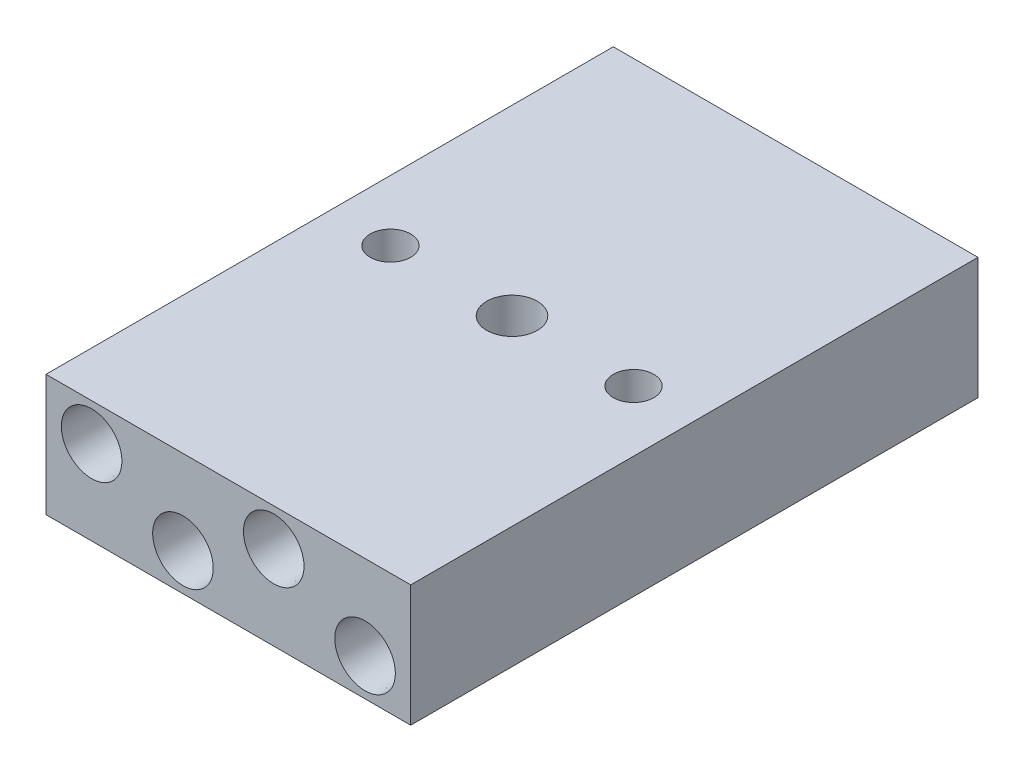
ISO-10303-21;
HEADER;
FILE_DESCRIPTION(('STEP AP214'),'2;1');
FILE_NAME('part.step','',(''),(''),'','','');
FILE_SCHEMA(('AUTOMOTIVE_DESIGN { 1 0 10303 214 1 1 1 1 }'));
ENDSEC;
DATA;
#1=APPLICATION_CONTEXT('core data for automotive mechanical design processes');
#2=APPLICATION_PROTOCOL_DEFINITION('international standard','automotive_design',2000,#1);
#3=PRODUCT_CONTEXT('',#1,'mechanical');
#4=PRODUCT('Part','Part','',(#3));
#5=PRODUCT_RELATED_PRODUCT_CATEGORY('part','',(#4));
#6=PRODUCT_DEFINITION_FORMATION('','',#4);
#7=PRODUCT_DEFINITION_CONTEXT('part definition',#1,'design');
#8=PRODUCT_DEFINITION('design','',#6,#7);
#9=PRODUCT_DEFINITION_SHAPE('','',#8);
#10=(LENGTH_UNIT() NAMED_UNIT(*) SI_UNIT(.MILLI.,.METRE.));
#11=(NAMED_UNIT(*) PLANE_ANGLE_UNIT() SI_UNIT($,.RADIAN.));
#12=(NAMED_UNIT(*) SI_UNIT($,.STERADIAN.) SOLID_ANGLE_UNIT());
#13=UNCERTAINTY_MEASURE_WITH_UNIT(LENGTH_MEASURE(1.E-05),#10,'distance_accuracy_value','');
#14=(GEOMETRIC_REPRESENTATION_CONTEXT(3) GLOBAL_UNCERTAINTY_ASSIGNED_CONTEXT((#13)) GLOBAL_UNIT_ASSIGNED_CONTEXT((#10,
#11,#12)) REPRESENTATION_CONTEXT('',''));
#15=CARTESIAN_POINT('',(0.,0.,0.));
#16=DIRECTION('',(0.,0.,1.));
#17=DIRECTION('',(1.,0.,0.));
#18=AXIS2_PLACEMENT_3D('',#15,#16,#17);
#19=CARTESIAN_POINT('',(-28.575,9.525,-88.9));
#20=DIRECTION('',(-1.,0.,0.));
#21=DIRECTION('',(0.,0.,1.));
#22=AXIS2_PLACEMENT_3D('',#19,#20,#21);
#23=PLANE('',#22);
#24=DIRECTION('',(0.,-1.,0.));
#25=VECTOR('',#24,1.);
#26=CARTESIAN_POINT('',(-28.575,9.525,0.));
#27=LINE('',#26,#25);
#28=CARTESIAN_POINT('',(-28.575,9.525,0.));
#29=VERTEX_POINT('',#28);
#30=CARTESIAN_POINT('',(-28.575,-9.525,0.));
#31=VERTEX_POINT('',#30);
#32=EDGE_CURVE('E145',#29,#31,#27,.T.);
#33=ORIENTED_EDGE('',*,*,#32,.F.);
#34=DIRECTION('',(0.,0.,1.));
#35=VECTOR('',#34,1.);
#36=CARTESIAN_POINT('',(-28.575,9.525,-88.9));
#37=LINE('',#36,#35);
#38=CARTESIAN_POINT('',(-28.575,9.525,-88.9));
#39=VERTEX_POINT('',#38);
#40=EDGE_CURVE('E11',#39,#29,#37,.T.);
#41=ORIENTED_EDGE('',*,*,#40,.F.);
#42=DIRECTION('',(0.,-1.,0.));
#43=VECTOR('',#42,1.);
#44=CARTESIAN_POINT('',(-28.575,9.525,-88.9));
#45=LINE('',#44,#43);
#46=CARTESIAN_POINT('',(-28.575,-9.525,-88.9));
#47=VERTEX_POINT('',#46);
#48=EDGE_CURVE('E146',#39,#47,#45,.T.);
#49=ORIENTED_EDGE('',*,*,#48,.T.);
#50=DIRECTION('',(0.,0.,1.));
#51=VECTOR('',#50,1.);
#52=CARTESIAN_POINT('',(-28.575,-9.525,-88.9));
#53=LINE('',#52,#51);
#54=EDGE_CURVE('E37',#47,#31,#53,.T.);
#55=ORIENTED_EDGE('',*,*,#54,.T.);
#56=EDGE_LOOP('',(#33,#41,#49,#55));
#57=FACE_BOUND('',#56,.T.);
#58=ADVANCED_FACE('F34',(#57),#23,.T.);
#59=CARTESIAN_POINT('',(-28.575,9.525,-88.9));
#60=DIRECTION('',(0.,1.,0.));
#61=DIRECTION('',(0.,0.,1.));
#62=AXIS2_PLACEMENT_3D('',#59,#60,#61);
#63=PLANE('',#62);
#64=CARTESIAN_POINT('',(19.05,9.525,-44.45));
#65=DIRECTION('',(0.,1.,0.));
#66=DIRECTION('',(0.,0.,-1.));
#67=AXIS2_PLACEMENT_3D('',#64,#65,#66);
#68=CIRCLE('',#67,3.175);
#69=CARTESIAN_POINT('',(19.05,9.525,-47.625));
#70=VERTEX_POINT('',#69);
#71=EDGE_CURVE('E198',#70,#70,#68,.T.);
#72=ORIENTED_EDGE('',*,*,#71,.F.);
#73=EDGE_LOOP('',(#72));
#74=FACE_BOUND('',#73,.T.);
#75=CARTESIAN_POINT('',(-19.05,9.525,-44.45));
#76=DIRECTION('',(0.,1.,0.));
#77=DIRECTION('',(0.,0.,1.));
#78=AXIS2_PLACEMENT_3D('',#75,#76,#77);
#79=CIRCLE('',#78,3.175);
#80=CARTESIAN_POINT('',(-19.05,9.525,-41.275));
#81=VERTEX_POINT('',#80);
#82=EDGE_CURVE('E202',#81,#81,#79,.T.);
#83=ORIENTED_EDGE('',*,*,#82,.F.);
#84=EDGE_LOOP('',(#83));
#85=FACE_BOUND('',#84,.T.);
#86=CARTESIAN_POINT('',(0.,9.525,-44.45));
#87=DIRECTION('',(0.,-1.,0.));
#88=DIRECTION('',(0.,0.,-1.));
#89=AXIS2_PLACEMENT_3D('',#86,#87,#88);
#90=CIRCLE('',#89,3.96875);
#91=CARTESIAN_POINT('',(0.,9.525,-48.41875));
#92=VERTEX_POINT('',#91);
#93=EDGE_CURVE('E205',#92,#92,#90,.T.);
#94=ORIENTED_EDGE('',*,*,#93,.T.);
#95=EDGE_LOOP('',(#94));
#96=FACE_BOUND('',#95,.T.);
#97=DIRECTION('',(-1.,0.,0.));
#98=VECTOR('',#97,1.);
#99=CARTESIAN_POINT('',(-28.575,9.525,0.));
#100=LINE('',#99,#98);
#101=CARTESIAN_POINT('',(28.575,9.525,0.));
#102=VERTEX_POINT('',#101);
#103=EDGE_CURVE('E149',#102,#29,#100,.T.);
#104=ORIENTED_EDGE('',*,*,#103,.F.);
#105=DIRECTION('',(0.,0.,1.));
#106=VECTOR('',#105,1.);
#107=CARTESIAN_POINT('',(28.575,9.525,-88.9));
#108=LINE('',#107,#106);
#109=CARTESIAN_POINT('',(28.575,9.525,-88.9));
#110=VERTEX_POINT('',#109);
#111=EDGE_CURVE('E43',#110,#102,#108,.T.);
#112=ORIENTED_EDGE('',*,*,#111,.F.);
#113=DIRECTION('',(-1.,0.,0.));
#114=VECTOR('',#113,1.);
#115=CARTESIAN_POINT('',(-28.575,9.525,-88.9));
#116=LINE('',#115,#114);
#117=EDGE_CURVE('E153',#110,#39,#116,.T.);
#118=ORIENTED_EDGE('',*,*,#117,.T.);
#119=ORIENTED_EDGE('',*,*,#40,.T.);
#120=EDGE_LOOP('',(#104,#112,#118,#119));
#121=FACE_BOUND('',#120,.T.);
#122=ADVANCED_FACE('F168',(#74,#85,#96,#121),#63,.T.);
#123=CARTESIAN_POINT('',(28.575,9.525,-88.9));
#124=DIRECTION('',(1.,0.,0.));
#125=DIRECTION('',(0.,0.,-1.));
#126=AXIS2_PLACEMENT_3D('',#123,#124,#125);
#127=PLANE('',#126);
#128=DIRECTION('',(0.,1.,0.));
#129=VECTOR('',#128,1.);
#130=CARTESIAN_POINT('',(28.575,9.525,0.));
#131=LINE('',#130,#129);
#132=CARTESIAN_POINT('',(28.575,-9.525,0.));
#133=VERTEX_POINT('',#132);
#134=EDGE_CURVE('E160',#133,#102,#131,.T.);
#135=ORIENTED_EDGE('',*,*,#134,.F.);
#136=DIRECTION('',(0.,0.,1.));
#137=VECTOR('',#136,1.);
#138=CARTESIAN_POINT('',(28.575,-9.525,-88.9));
#139=LINE('',#138,#137);
#140=CARTESIAN_POINT('',(28.575,-9.525,-88.9));
#141=VERTEX_POINT('',#140);
#142=EDGE_CURVE('E164',#141,#133,#139,.T.);
#143=ORIENTED_EDGE('',*,*,#142,.F.);
#144=DIRECTION('',(0.,1.,0.));
#145=VECTOR('',#144,1.);
#146=CARTESIAN_POINT('',(28.575,9.525,-88.9));
#147=LINE('',#146,#145);
#148=EDGE_CURVE('E151',#141,#110,#147,.T.);
#149=ORIENTED_EDGE('',*,*,#148,.T.);
#150=ORIENTED_EDGE('',*,*,#111,.T.);
#151=EDGE_LOOP('',(#135,#143,#149,#150));
#152=FACE_BOUND('',#151,.T.);
#153=ADVANCED_FACE('F171',(#152),#127,.T.);
#154=CARTESIAN_POINT('',(-28.575,-9.525,-88.9));
#155=DIRECTION('',(0.,-1.,0.));
#156=DIRECTION('',(0.,0.,-1.));
#157=AXIS2_PLACEMENT_3D('',#154,#155,#156);
#158=PLANE('',#157);
#159=CARTESIAN_POINT('',(0.,-9.525,-44.45));
#160=DIRECTION('',(0.,-1.,0.));
#161=DIRECTION('',(0.,0.,-1.));
#162=AXIS2_PLACEMENT_3D('',#159,#160,#161);
#163=CIRCLE('',#162,3.96875);
#164=CARTESIAN_POINT('',(0.,-9.525,-48.41875));
#165=VERTEX_POINT('',#164);
#166=EDGE_CURVE('E208',#165,#165,#163,.T.);
#167=ORIENTED_EDGE('',*,*,#166,.F.);
#168=EDGE_LOOP('',(#167));
#169=FACE_BOUND('',#168,.T.);
#170=DIRECTION('',(1.,0.,0.));
#171=VECTOR('',#170,1.);
#172=CARTESIAN_POINT('',(-28.575,-9.525,0.));
#173=LINE('',#172,#171);
#174=EDGE_CURVE('E157',#31,#133,#173,.T.);
#175=ORIENTED_EDGE('',*,*,#174,.F.);
#176=ORIENTED_EDGE('',*,*,#54,.F.);
#177=DIRECTION('',(1.,0.,0.));
#178=VECTOR('',#177,1.);
#179=CARTESIAN_POINT('',(-28.575,-9.525,-88.9));
#180=LINE('',#179,#178);
#181=EDGE_CURVE('E148',#47,#141,#180,.T.);
#182=ORIENTED_EDGE('',*,*,#181,.T.);
#183=ORIENTED_EDGE('',*,*,#142,.T.);
#184=EDGE_LOOP('',(#175,#176,#182,#183));
#185=FACE_BOUND('',#184,.T.);
#186=ADVANCED_FACE('F165',(#169,#185),#158,.T.);
#187=CARTESIAN_POINT('',(-28.575,-9.525,-88.9));
#188=DIRECTION('',(0.,0.,1.));
#189=DIRECTION('',(1.,0.,0.));
#190=AXIS2_PLACEMENT_3D('',#187,#188,#189);
#191=PLANE('',#190);
#192=ORIENTED_EDGE('',*,*,#48,.F.);
#193=ORIENTED_EDGE('',*,*,#117,.F.);
#194=ORIENTED_EDGE('',*,*,#148,.F.);
#195=ORIENTED_EDGE('',*,*,#181,.F.);
#196=EDGE_LOOP('',(#192,#193,#194,#195));
#197=FACE_BOUND('',#196,.T.);
#198=ADVANCED_FACE('F173',(#197),#191,.F.);
#199=CARTESIAN_POINT('',(-28.575,-9.525,0.));
#200=DIRECTION('',(0.,0.,1.));
#201=DIRECTION('',(1.,0.,0.));
#202=AXIS2_PLACEMENT_3D('',#199,#200,#201);
#203=PLANE('',#202);
#204=CARTESIAN_POINT('',(-21.4249,3.683,0.));
#205=DIRECTION('',(0.,0.,1.));
#206=DIRECTION('',(1.,0.,0.));
#207=AXIS2_PLACEMENT_3D('',#204,#205,#206);
#208=CIRCLE('',#207,4.74472);
#209=CARTESIAN_POINT('',(-16.68018,3.683,0.));
#210=VERTEX_POINT('',#209);
#211=EDGE_CURVE('E207',#210,#210,#208,.T.);
#212=ORIENTED_EDGE('',*,*,#211,.F.);
#213=EDGE_LOOP('',(#212));
#214=FACE_BOUND('',#213,.T.);
#215=CARTESIAN_POINT('',(-7.112,-3.683,0.));
#216=DIRECTION('',(0.,0.,1.));
#217=DIRECTION('',(1.,0.,0.));
#218=AXIS2_PLACEMENT_3D('',#215,#216,#217);
#219=CIRCLE('',#218,4.74472);
#220=CARTESIAN_POINT('',(-2.36728,-3.683,0.));
#221=VERTEX_POINT('',#220);
#222=EDGE_CURVE('E102',#221,#221,#219,.T.);
#223=ORIENTED_EDGE('',*,*,#222,.F.);
#224=EDGE_LOOP('',(#223));
#225=FACE_BOUND('',#224,.T.);
#226=CARTESIAN_POINT('',(7.112,3.683,0.));
#227=DIRECTION('',(0.,0.,1.));
#228=DIRECTION('',(1.,0.,0.));
#229=AXIS2_PLACEMENT_3D('',#226,#227,#228);
#230=CIRCLE('',#229,4.74472);
#231=CARTESIAN_POINT('',(11.85672,3.683,0.));
#232=VERTEX_POINT('',#231);
#233=EDGE_CURVE('E121',#232,#232,#230,.T.);
#234=ORIENTED_EDGE('',*,*,#233,.F.);
#235=EDGE_LOOP('',(#234));
#236=FACE_BOUND('',#235,.T.);
#237=CARTESIAN_POINT('',(21.4249,-3.683,0.));
#238=DIRECTION('',(0.,0.,1.));
#239=DIRECTION('',(1.,0.,0.));
#240=AXIS2_PLACEMENT_3D('',#237,#238,#239);
#241=CIRCLE('',#240,4.74472);
#242=CARTESIAN_POINT('',(26.16962,-3.683,0.));
#243=VERTEX_POINT('',#242);
#244=EDGE_CURVE('E133',#243,#243,#241,.T.);
#245=ORIENTED_EDGE('',*,*,#244,.F.);
#246=EDGE_LOOP('',(#245));
#247=FACE_BOUND('',#246,.T.);
#248=ORIENTED_EDGE('',*,*,#32,.T.);
#249=ORIENTED_EDGE('',*,*,#174,.T.);
#250=ORIENTED_EDGE('',*,*,#134,.T.);
#251=ORIENTED_EDGE('',*,*,#103,.T.);
#252=EDGE_LOOP('',(#248,#249,#250,#251));
#253=FACE_BOUND('',#252,.T.);
#254=ADVANCED_FACE('F167',(#214,#225,#236,#247,#253),#203,.T.);
#255=CARTESIAN_POINT('',(21.4249,-3.683,-11.6229892));
#256=DIRECTION('',(0.,0.,1.));
#257=DIRECTION('',(1.,0.,0.));
#258=AXIS2_PLACEMENT_3D('',#255,#256,#257);
#259=CONICAL_SURFACE('',#258,4.21640000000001,1.02974425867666);
#260=CARTESIAN_POINT('',(21.4249,-3.683,-14.1564579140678));
#261=VERTEX_POINT('',#260);
#262=VERTEX_LOOP('',#261);
#263=FACE_BOUND('',#262,.T.);
#264=CARTESIAN_POINT('',(21.4249,-3.683,-11.6229892));
#265=DIRECTION('',(0.,0.,1.));
#266=DIRECTION('',(1.,0.,0.));
#267=AXIS2_PLACEMENT_3D('',#264,#265,#266);
#268=CIRCLE('',#267,4.21640000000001);
#269=CARTESIAN_POINT('',(25.6413,-3.683,-11.6229892));
#270=VERTEX_POINT('',#269);
#271=EDGE_CURVE('E142',#270,#270,#268,.T.);
#272=ORIENTED_EDGE('',*,*,#271,.T.);
#273=EDGE_LOOP('',(#272));
#274=FACE_BOUND('',#273,.T.);
#275=ADVANCED_FACE('F180',(#263,#274),#259,.F.);
#276=CARTESIAN_POINT('',(21.4249,-3.683,0.));
#277=DIRECTION('',(0.,0.,1.));
#278=DIRECTION('',(1.,0.,0.));
#279=AXIS2_PLACEMENT_3D('',#276,#277,#278);
#280=CYLINDRICAL_SURFACE('',#279,4.21640000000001);
#281=ORIENTED_EDGE('',*,*,#271,.F.);
#282=EDGE_LOOP('',(#281));
#283=FACE_BOUND('',#282,.T.);
#284=CARTESIAN_POINT('',(21.4249,-3.683,-6.9239892));
#285=DIRECTION('',(0.,0.,1.));
#286=DIRECTION('',(1.,0.,0.));
#287=AXIS2_PLACEMENT_3D('',#284,#285,#286);
#288=CIRCLE('',#287,4.2164);
#289=CARTESIAN_POINT('',(25.6413,-3.683,-6.9239892));
#290=VERTEX_POINT('',#289);
#291=EDGE_CURVE('E139',#290,#290,#288,.T.);
#292=ORIENTED_EDGE('',*,*,#291,.T.);
#293=EDGE_LOOP('',(#292));
#294=FACE_BOUND('',#293,.T.);
#295=ADVANCED_FACE('F248',(#283,#294),#280,.F.);
#296=CARTESIAN_POINT('',(25.6413,-3.683,-6.9239892));
#297=DIRECTION('',(0.,0.,-1.));
#298=DIRECTION('',(-1.,0.,0.));
#299=AXIS2_PLACEMENT_3D('',#296,#297,#298);
#300=PLANE('',#299);
#301=ORIENTED_EDGE('',*,*,#291,.F.);
#302=EDGE_LOOP('',(#301));
#303=FACE_BOUND('',#302,.T.);
#304=CARTESIAN_POINT('',(21.4249,-3.683,-6.9239892));
#305=DIRECTION('',(0.,0.,1.));
#306=DIRECTION('',(1.,0.,0.));
#307=AXIS2_PLACEMENT_3D('',#304,#305,#306);
#308=CIRCLE('',#307,4.53740649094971);
#309=CARTESIAN_POINT('',(25.9623064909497,-3.683,-6.9239892));
#310=VERTEX_POINT('',#309);
#311=EDGE_CURVE('E136',#310,#310,#308,.T.);
#312=ORIENTED_EDGE('',*,*,#311,.T.);
#313=EDGE_LOOP('',(#312));
#314=FACE_BOUND('',#313,.T.);
#315=ADVANCED_FACE('F238',(#303,#314),#300,.F.);
#316=CARTESIAN_POINT('',(21.4249,-3.683,0.));
#317=DIRECTION('',(0.,0.,1.));
#318=DIRECTION('',(1.,0.,0.));
#319=AXIS2_PLACEMENT_3D('',#316,#317,#318);
#320=CONICAL_SURFACE('',#319,4.74472,0.0299323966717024);
#321=ORIENTED_EDGE('',*,*,#311,.F.);
#322=EDGE_LOOP('',(#321));
#323=FACE_BOUND('',#322,.T.);
#324=ORIENTED_EDGE('',*,*,#244,.T.);
#325=EDGE_LOOP('',(#324));
#326=FACE_BOUND('',#325,.T.);
#327=ADVANCED_FACE('F235',(#323,#326),#320,.F.);
#328=CARTESIAN_POINT('',(7.112,3.683,-11.6229892));
#329=DIRECTION('',(0.,0.,1.));
#330=DIRECTION('',(1.,0.,0.));
#331=AXIS2_PLACEMENT_3D('',#328,#329,#330);
#332=CONICAL_SURFACE('',#331,4.21640000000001,1.02974425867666);
#333=CARTESIAN_POINT('',(7.112,3.683,-14.1564579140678));
#334=VERTEX_POINT('',#333);
#335=VERTEX_LOOP('',#334);
#336=FACE_BOUND('',#335,.T.);
#337=CARTESIAN_POINT('',(7.112,3.683,-11.6229892));
#338=DIRECTION('',(0.,0.,1.));
#339=DIRECTION('',(1.,0.,0.));
#340=AXIS2_PLACEMENT_3D('',#337,#338,#339);
#341=CIRCLE('',#340,4.21640000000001);
#342=CARTESIAN_POINT('',(11.3284,3.683,-11.6229892));
#343=VERTEX_POINT('',#342);
#344=EDGE_CURVE('E130',#343,#343,#341,.T.);
#345=ORIENTED_EDGE('',*,*,#344,.T.);
#346=EDGE_LOOP('',(#345));
#347=FACE_BOUND('',#346,.T.);
#348=ADVANCED_FACE('F237',(#336,#347),#332,.F.);
#349=CARTESIAN_POINT('',(7.112,3.683,0.));
#350=DIRECTION('',(0.,0.,1.));
#351=DIRECTION('',(1.,0.,0.));
#352=AXIS2_PLACEMENT_3D('',#349,#350,#351);
#353=CYLINDRICAL_SURFACE('',#352,4.21640000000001);
#354=ORIENTED_EDGE('',*,*,#344,.F.);
#355=EDGE_LOOP('',(#354));
#356=FACE_BOUND('',#355,.T.);
#357=CARTESIAN_POINT('',(7.112,3.683,-6.9239892));
#358=DIRECTION('',(0.,0.,1.));
#359=DIRECTION('',(1.,0.,0.));
#360=AXIS2_PLACEMENT_3D('',#357,#358,#359);
#361=CIRCLE('',#360,4.2164);
#362=CARTESIAN_POINT('',(11.3284,3.683,-6.9239892));
#363=VERTEX_POINT('',#362);
#364=EDGE_CURVE('E127',#363,#363,#361,.T.);
#365=ORIENTED_EDGE('',*,*,#364,.T.);
#366=EDGE_LOOP('',(#365));
#367=FACE_BOUND('',#366,.T.);
#368=ADVANCED_FACE('F245',(#356,#367),#353,.F.);
#369=CARTESIAN_POINT('',(11.3284,3.683,-6.9239892));
#370=DIRECTION('',(0.,0.,-1.));
#371=DIRECTION('',(-1.,0.,0.));
#372=AXIS2_PLACEMENT_3D('',#369,#370,#371);
#373=PLANE('',#372);
#374=ORIENTED_EDGE('',*,*,#364,.F.);
#375=EDGE_LOOP('',(#374));
#376=FACE_BOUND('',#375,.T.);
#377=CARTESIAN_POINT('',(7.112,3.683,-6.9239892));
#378=DIRECTION('',(0.,0.,1.));
#379=DIRECTION('',(1.,0.,0.));
#380=AXIS2_PLACEMENT_3D('',#377,#378,#379);
#381=CIRCLE('',#380,4.53740649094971);
#382=CARTESIAN_POINT('',(11.6494064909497,3.683,-6.9239892));
#383=VERTEX_POINT('',#382);
#384=EDGE_CURVE('E124',#383,#383,#381,.T.);
#385=ORIENTED_EDGE('',*,*,#384,.T.);
#386=EDGE_LOOP('',(#385));
#387=FACE_BOUND('',#386,.T.);
#388=ADVANCED_FACE('F297',(#376,#387),#373,.F.);
#389=CARTESIAN_POINT('',(7.112,3.683,0.));
#390=DIRECTION('',(0.,0.,1.));
#391=DIRECTION('',(1.,0.,0.));
#392=AXIS2_PLACEMENT_3D('',#389,#390,#391);
#393=CONICAL_SURFACE('',#392,4.74472,0.0299323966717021);
#394=ORIENTED_EDGE('',*,*,#384,.F.);
#395=EDGE_LOOP('',(#394));
#396=FACE_BOUND('',#395,.T.);
#397=ORIENTED_EDGE('',*,*,#233,.T.);
#398=EDGE_LOOP('',(#397));
#399=FACE_BOUND('',#398,.T.);
#400=ADVANCED_FACE('F306',(#396,#399),#393,.F.);
#401=CARTESIAN_POINT('',(-7.112,-3.683,-11.6229892));
#402=DIRECTION('',(0.,0.,1.));
#403=DIRECTION('',(1.,0.,0.));
#404=AXIS2_PLACEMENT_3D('',#401,#402,#403);
#405=CONICAL_SURFACE('',#404,4.21640000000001,1.02974425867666);
#406=CARTESIAN_POINT('',(-7.112,-3.683,-14.1564579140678));
#407=VERTEX_POINT('',#406);
#408=VERTEX_LOOP('',#407);
#409=FACE_BOUND('',#408,.T.);
#410=CARTESIAN_POINT('',(-7.112,-3.683,-11.6229892));
#411=DIRECTION('',(0.,0.,1.));
#412=DIRECTION('',(1.,0.,0.));
#413=AXIS2_PLACEMENT_3D('',#410,#411,#412);
#414=CIRCLE('',#413,4.21640000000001);
#415=CARTESIAN_POINT('',(-2.89559999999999,-3.683,-11.6229892));
#416=VERTEX_POINT('',#415);
#417=EDGE_CURVE('E118',#416,#416,#414,.T.);
#418=ORIENTED_EDGE('',*,*,#417,.T.);
#419=EDGE_LOOP('',(#418));
#420=FACE_BOUND('',#419,.T.);
#421=ADVANCED_FACE('F316',(#409,#420),#405,.F.);
#422=CARTESIAN_POINT('',(-7.112,-3.683,0.));
#423=DIRECTION('',(0.,0.,1.));
#424=DIRECTION('',(1.,0.,0.));
#425=AXIS2_PLACEMENT_3D('',#422,#423,#424);
#426=CYLINDRICAL_SURFACE('',#425,4.21640000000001);
#427=ORIENTED_EDGE('',*,*,#417,.F.);
#428=EDGE_LOOP('',(#427));
#429=FACE_BOUND('',#428,.T.);
#430=CARTESIAN_POINT('',(-7.112,-3.683,-6.9239892));
#431=DIRECTION('',(0.,0.,1.));
#432=DIRECTION('',(1.,0.,0.));
#433=AXIS2_PLACEMENT_3D('',#430,#431,#432);
#434=CIRCLE('',#433,4.2164);
#435=CARTESIAN_POINT('',(-2.8956,-3.683,-6.9239892));
#436=VERTEX_POINT('',#435);
#437=EDGE_CURVE('E115',#436,#436,#434,.T.);
#438=ORIENTED_EDGE('',*,*,#437,.T.);
#439=EDGE_LOOP('',(#438));
#440=FACE_BOUND('',#439,.T.);
#441=ADVANCED_FACE('F327',(#429,#440),#426,.F.);
#442=CARTESIAN_POINT('',(-2.8956,-3.683,-6.9239892));
#443=DIRECTION('',(0.,0.,-1.));
#444=DIRECTION('',(-1.,0.,0.));
#445=AXIS2_PLACEMENT_3D('',#442,#443,#444);
#446=PLANE('',#445);
#447=ORIENTED_EDGE('',*,*,#437,.F.);
#448=EDGE_LOOP('',(#447));
#449=FACE_BOUND('',#448,.T.);
#450=CARTESIAN_POINT('',(-7.112,-3.683,-6.9239892));
#451=DIRECTION('',(0.,0.,1.));
#452=DIRECTION('',(1.,0.,0.));
#453=AXIS2_PLACEMENT_3D('',#450,#451,#452);
#454=CIRCLE('',#453,4.53740649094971);
#455=CARTESIAN_POINT('',(-2.57459350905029,-3.683,-6.9239892));
#456=VERTEX_POINT('',#455);
#457=EDGE_CURVE('E106',#456,#456,#454,.T.);
#458=ORIENTED_EDGE('',*,*,#457,.T.);
#459=EDGE_LOOP('',(#458));
#460=FACE_BOUND('',#459,.T.);
#461=ADVANCED_FACE('F337',(#449,#460),#446,.F.);
#462=CARTESIAN_POINT('',(-7.112,-3.683,0.));
#463=DIRECTION('',(0.,0.,1.));
#464=DIRECTION('',(1.,0.,0.));
#465=AXIS2_PLACEMENT_3D('',#462,#463,#464);
#466=CONICAL_SURFACE('',#465,4.74472,0.0299323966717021);
#467=ORIENTED_EDGE('',*,*,#457,.F.);
#468=EDGE_LOOP('',(#467));
#469=FACE_BOUND('',#468,.T.);
#470=ORIENTED_EDGE('',*,*,#222,.T.);
#471=EDGE_LOOP('',(#470));
#472=FACE_BOUND('',#471,.T.);
#473=ADVANCED_FACE('F96',(#469,#472),#466,.F.);
#474=CARTESIAN_POINT('',(-21.4249,3.683,-11.6229892));
#475=DIRECTION('',(0.,0.,1.));
#476=DIRECTION('',(1.,0.,0.));
#477=AXIS2_PLACEMENT_3D('',#474,#475,#476);
#478=CONICAL_SURFACE('',#477,4.21640000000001,1.02974425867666);
#479=CARTESIAN_POINT('',(-21.4249,3.683,-14.1564579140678));
#480=VERTEX_POINT('',#479);
#481=VERTEX_LOOP('',#480);
#482=FACE_BOUND('',#481,.T.);
#483=CARTESIAN_POINT('',(-21.4249,3.683,-11.6229892));
#484=DIRECTION('',(0.,0.,1.));
#485=DIRECTION('',(1.,0.,0.));
#486=AXIS2_PLACEMENT_3D('',#483,#484,#485);
#487=CIRCLE('',#486,4.21640000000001);
#488=CARTESIAN_POINT('',(-17.2085,3.683,-11.6229892));
#489=VERTEX_POINT('',#488);
#490=EDGE_CURVE('E100',#489,#489,#487,.T.);
#491=ORIENTED_EDGE('',*,*,#490,.T.);
#492=EDGE_LOOP('',(#491));
#493=FACE_BOUND('',#492,.T.);
#494=ADVANCED_FACE('F92',(#482,#493),#478,.F.);
#495=CARTESIAN_POINT('',(-21.4249,3.683,0.));
#496=DIRECTION('',(0.,0.,1.));
#497=DIRECTION('',(1.,0.,0.));
#498=AXIS2_PLACEMENT_3D('',#495,#496,#497);
#499=CYLINDRICAL_SURFACE('',#498,4.21640000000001);
#500=ORIENTED_EDGE('',*,*,#490,.F.);
#501=EDGE_LOOP('',(#500));
#502=FACE_BOUND('',#501,.T.);
#503=CARTESIAN_POINT('',(-21.4249,3.683,-6.9239892));
#504=DIRECTION('',(0.,0.,1.));
#505=DIRECTION('',(1.,0.,0.));
#506=AXIS2_PLACEMENT_3D('',#503,#504,#505);
#507=CIRCLE('',#506,4.2164);
#508=CARTESIAN_POINT('',(-17.2085,3.683,-6.9239892));
#509=VERTEX_POINT('',#508);
#510=EDGE_CURVE('E103',#509,#509,#507,.T.);
#511=ORIENTED_EDGE('',*,*,#510,.T.);
#512=EDGE_LOOP('',(#511));
#513=FACE_BOUND('',#512,.T.);
#514=ADVANCED_FACE('F95',(#502,#513),#499,.F.);
#515=CARTESIAN_POINT('',(-17.2085,3.683,-6.9239892));
#516=DIRECTION('',(0.,0.,-1.));
#517=DIRECTION('',(-1.,0.,0.));
#518=AXIS2_PLACEMENT_3D('',#515,#516,#517);
#519=PLANE('',#518);
#520=ORIENTED_EDGE('',*,*,#510,.F.);
#521=EDGE_LOOP('',(#520));
#522=FACE_BOUND('',#521,.T.);
#523=CARTESIAN_POINT('',(-21.4249,3.683,-6.9239892));
#524=DIRECTION('',(0.,0.,1.));
#525=DIRECTION('',(1.,0.,0.));
#526=AXIS2_PLACEMENT_3D('',#523,#524,#525);
#527=CIRCLE('',#526,4.53740649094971);
#528=CARTESIAN_POINT('',(-16.8874935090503,3.683,-6.9239892));
#529=VERTEX_POINT('',#528);
#530=EDGE_CURVE('E109',#529,#529,#527,.T.);
#531=ORIENTED_EDGE('',*,*,#530,.T.);
#532=EDGE_LOOP('',(#531));
#533=FACE_BOUND('',#532,.T.);
#534=ADVANCED_FACE('F220',(#522,#533),#519,.F.);
#535=CARTESIAN_POINT('',(-21.4249,3.683,0.));
#536=DIRECTION('',(0.,0.,1.));
#537=DIRECTION('',(1.,0.,0.));
#538=AXIS2_PLACEMENT_3D('',#535,#536,#537);
#539=CONICAL_SURFACE('',#538,4.74472,0.0299323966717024);
#540=ORIENTED_EDGE('',*,*,#530,.F.);
#541=EDGE_LOOP('',(#540));
#542=FACE_BOUND('',#541,.T.);
#543=ORIENTED_EDGE('',*,*,#211,.T.);
#544=EDGE_LOOP('',(#543));
#545=FACE_BOUND('',#544,.T.);
#546=ADVANCED_FACE('F222',(#542,#545),#539,.F.);
#547=CARTESIAN_POINT('',(0.,9.525,-44.45));
#548=DIRECTION('',(0.,-1.,0.));
#549=DIRECTION('',(0.,0.,-1.));
#550=AXIS2_PLACEMENT_3D('',#547,#548,#549);
#551=CYLINDRICAL_SURFACE('',#550,3.96875);
#552=CARTESIAN_POINT('',(0.,9.525,-48.41875));
#553=CARTESIAN_POINT('',(0.,9.3265625,-48.41875));
#554=CARTESIAN_POINT('',(0.,9.128125,-48.41875));
#555=CARTESIAN_POINT('',(0.,8.73125,-48.41875));
#556=CARTESIAN_POINT('',(0.,8.5328125,-48.41875));
#557=CARTESIAN_POINT('',(0.,8.1359375,-48.41875));
#558=CARTESIAN_POINT('',(0.,7.9375,-48.41875));
#559=CARTESIAN_POINT('',(0.,7.540625,-48.41875));
#560=CARTESIAN_POINT('',(0.,7.3421875,-48.41875));
#561=CARTESIAN_POINT('',(0.,6.9453125,-48.41875));
#562=CARTESIAN_POINT('',(0.,6.746875,-48.41875));
#563=CARTESIAN_POINT('',(0.,6.35,-48.41875));
#564=CARTESIAN_POINT('',(0.,6.1515625,-48.41875));
#565=CARTESIAN_POINT('',(0.,5.7546875,-48.41875));
#566=CARTESIAN_POINT('',(0.,5.55625,-48.41875));
#567=CARTESIAN_POINT('',(0.,5.159375,-48.41875));
#568=CARTESIAN_POINT('',(0.,4.9609375,-48.41875));
#569=CARTESIAN_POINT('',(0.,4.5640625,-48.41875));
#570=CARTESIAN_POINT('',(0.,4.365625,-48.41875));
#571=CARTESIAN_POINT('',(0.,3.96875,-48.41875));
#572=CARTESIAN_POINT('',(0.,3.7703125,-48.41875));
#573=CARTESIAN_POINT('',(0.,3.3734375,-48.41875));
#574=CARTESIAN_POINT('',(0.,3.175,-48.41875));
#575=CARTESIAN_POINT('',(0.,2.778125,-48.41875));
#576=CARTESIAN_POINT('',(0.,2.5796875,-48.41875));
#577=CARTESIAN_POINT('',(0.,2.1828125,-48.41875));
#578=CARTESIAN_POINT('',(0.,1.984375,-48.41875));
#579=CARTESIAN_POINT('',(0.,1.5875,-48.41875));
#580=CARTESIAN_POINT('',(0.,1.3890625,-48.41875));
#581=CARTESIAN_POINT('',(0.,0.992187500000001,-48.41875));
#582=CARTESIAN_POINT('',(0.,0.793750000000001,-48.41875));
#583=CARTESIAN_POINT('',(0.,0.396875,-48.41875));
#584=CARTESIAN_POINT('',(0.,0.1984375,-48.41875));
#585=CARTESIAN_POINT('',(0.,-0.1984375,-48.41875));
#586=CARTESIAN_POINT('',(0.,-0.396875,-48.41875));
#587=CARTESIAN_POINT('',(0.,-0.793750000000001,-48.41875));
#588=CARTESIAN_POINT('',(0.,-0.992187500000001,-48.41875));
#589=CARTESIAN_POINT('',(0.,-1.3890625,-48.41875));
#590=CARTESIAN_POINT('',(0.,-1.5875,-48.41875));
#591=CARTESIAN_POINT('',(0.,-1.984375,-48.41875));
#592=CARTESIAN_POINT('',(0.,-2.1828125,-48.41875));
#593=CARTESIAN_POINT('',(0.,-2.5796875,-48.41875));
#594=CARTESIAN_POINT('',(0.,-2.778125,-48.41875));
#595=CARTESIAN_POINT('',(0.,-3.175,-48.41875));
#596=CARTESIAN_POINT('',(0.,-3.3734375,-48.41875));
#597=CARTESIAN_POINT('',(0.,-3.7703125,-48.41875));
#598=CARTESIAN_POINT('',(0.,-3.96875,-48.41875));
#599=CARTESIAN_POINT('',(0.,-4.365625,-48.41875));
#600=CARTESIAN_POINT('',(0.,-4.5640625,-48.41875));
#601=CARTESIAN_POINT('',(0.,-4.9609375,-48.41875));
#602=CARTESIAN_POINT('',(0.,-5.159375,-48.41875));
#603=CARTESIAN_POINT('',(0.,-5.55625,-48.41875));
#604=CARTESIAN_POINT('',(0.,-5.7546875,-48.41875));
#605=CARTESIAN_POINT('',(0.,-6.1515625,-48.41875));
#606=CARTESIAN_POINT('',(0.,-6.35,-48.41875));
#607=CARTESIAN_POINT('',(0.,-6.746875,-48.41875));
#608=CARTESIAN_POINT('',(0.,-6.9453125,-48.41875));
#609=CARTESIAN_POINT('',(0.,-7.3421875,-48.41875));
#610=CARTESIAN_POINT('',(0.,-7.540625,-48.41875));
#611=CARTESIAN_POINT('',(0.,-7.9375,-48.41875));
#612=CARTESIAN_POINT('',(0.,-8.1359375,-48.41875));
#613=CARTESIAN_POINT('',(0.,-8.5328125,-48.41875));
#614=CARTESIAN_POINT('',(0.,-8.73125,-48.41875));
#615=CARTESIAN_POINT('',(0.,-9.128125,-48.41875));
#616=CARTESIAN_POINT('',(0.,-9.3265625,-48.41875));
#617=CARTESIAN_POINT('',(0.,-9.525,-48.41875));
#618=B_SPLINE_CURVE_WITH_KNOTS('',3,(#552,#553,#554,#555,#556,#557,#558,#559,#560,#561,#562,
#563,#564,#565,#566,#567,#568,#569,#570,#571,#572,#573,#574,#575,#576,#577,#578,#579,#580,#581,
#582,#583,#584,#585,#586,#587,#588,#589,#590,#591,#592,#593,#594,#595,#596,#597,#598,#599,#600,
#601,#602,#603,#604,#605,#606,#607,#608,#609,#610,#611,#612,#613,#614,#615,#616,#617),
.UNSPECIFIED.,.F.,.F.,(4,2,2,2,2,2,2,2,2,2,2,2,2,2,2,2,2,2,2,2,2,2,2,2,2,2,2,2,2,2,2,2,4),(0.,
0.595312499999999,1.190625,1.7859375,2.38125,2.9765625,3.571875,4.1671875,4.7625,5.3578125,
5.953125,6.5484375,7.14375,7.7390625,8.334375,8.9296875,9.525,10.1203125,10.715625,11.3109375,
11.90625,12.5015625,13.096875,13.6921875,14.2875,14.8828125,15.478125,16.0734375,16.66875,
17.2640625,17.859375,18.4546875,19.05),.UNSPECIFIED.);
#619=EDGE_CURVE('BSEAM225',#92,#165,#618,.T.);
#620=ORIENTED_EDGE('',*,*,#93,.F.);
#621=ORIENTED_EDGE('',*,*,#166,.T.);
#622=ORIENTED_EDGE('',*,*,#619,.T.);
#623=ORIENTED_EDGE('',*,*,#619,.F.);
#624=EDGE_LOOP('',(#620,#622,#621,#623));
#625=FACE_BOUND('',#624,.T.);
#626=ADVANCED_FACE('F225',(#625),#551,.F.);
#627=CARTESIAN_POINT('',(-19.05,3.175,-44.45));
#628=DIRECTION('',(0.,1.,0.));
#629=DIRECTION('',(0.,0.,1.));
#630=AXIS2_PLACEMENT_3D('',#627,#628,#629);
#631=CYLINDRICAL_SURFACE('',#630,3.175);
#632=CARTESIAN_POINT('',(-19.05,3.175,-44.45));
#633=DIRECTION('',(0.,1.,0.));
#634=DIRECTION('',(0.,0.,1.));
#635=AXIS2_PLACEMENT_3D('',#632,#633,#634);
#636=CIRCLE('',#635,3.175);
#637=CARTESIAN_POINT('',(-19.05,3.175,-41.275));
#638=VERTEX_POINT('',#637);
#639=EDGE_CURVE('E213',#638,#638,#636,.T.);
#640=ORIENTED_EDGE('',*,*,#639,.F.);
#641=EDGE_LOOP('',(#640));
#642=FACE_BOUND('',#641,.T.);
#643=ORIENTED_EDGE('',*,*,#82,.T.);
#644=EDGE_LOOP('',(#643));
#645=FACE_BOUND('',#644,.T.);
#646=ADVANCED_FACE('F402',(#642,#645),#631,.F.);
#647=CARTESIAN_POINT('',(-19.05,3.175,-44.45));
#648=DIRECTION('',(0.,1.,0.));
#649=DIRECTION('',(0.,0.,1.));
#650=AXIS2_PLACEMENT_3D('',#647,#648,#649);
#651=PLANE('',#650);
#652=ORIENTED_EDGE('',*,*,#639,.T.);
#653=EDGE_LOOP('',(#652));
#654=FACE_BOUND('',#653,.T.);
#655=ADVANCED_FACE('F417',(#654),#651,.T.);
#656=CARTESIAN_POINT('',(19.05,3.175,-44.45));
#657=DIRECTION('',(0.,1.,0.));
#658=DIRECTION('',(0.,0.,1.));
#659=AXIS2_PLACEMENT_3D('',#656,#657,#658);
#660=CYLINDRICAL_SURFACE('',#659,3.175);
#661=CARTESIAN_POINT('',(19.05,3.175,-44.45));
#662=DIRECTION('',(0.,1.,0.));
#663=DIRECTION('',(0.,0.,-1.));
#664=AXIS2_PLACEMENT_3D('',#661,#662,#663);
#665=CIRCLE('',#664,3.175);
#666=CARTESIAN_POINT('',(19.05,3.175,-47.625));
#667=VERTEX_POINT('',#666);
#668=EDGE_CURVE('E453',#667,#667,#665,.T.);
#669=ORIENTED_EDGE('',*,*,#668,.F.);
#670=EDGE_LOOP('',(#669));
#671=FACE_BOUND('',#670,.T.);
#672=ORIENTED_EDGE('',*,*,#71,.T.);
#673=EDGE_LOOP('',(#672));
#674=FACE_BOUND('',#673,.T.);
#675=ADVANCED_FACE('F427',(#671,#674),#660,.F.);
#676=CARTESIAN_POINT('',(19.05,3.175,-44.45));
#677=DIRECTION('',(0.,-1.,0.));
#678=DIRECTION('',(0.,0.,-1.));
#679=AXIS2_PLACEMENT_3D('',#676,#677,#678);
#680=PLANE('',#679);
#681=ORIENTED_EDGE('',*,*,#668,.T.);
#682=EDGE_LOOP('',(#681));
#683=FACE_BOUND('',#682,.T.);
#684=ADVANCED_FACE('F437',(#683),#680,.F.);
#685=CLOSED_SHELL('',(#58,#122,#153,#186,#198,#254,#275,#295,#315,#327,#348,#368,#388,#400,#421,
#441,#461,#473,#494,#514,#534,#546,#626,#646,#655,#675,#684));
#686=MANIFOLD_SOLID_BREP('B2',#685);
#687=ADVANCED_BREP_SHAPE_REPRESENTATION('',(#18,#686),#14);
#688=SHAPE_DEFINITION_REPRESENTATION(#9,#687);
ENDSEC;
END-ISO-10303-21;
